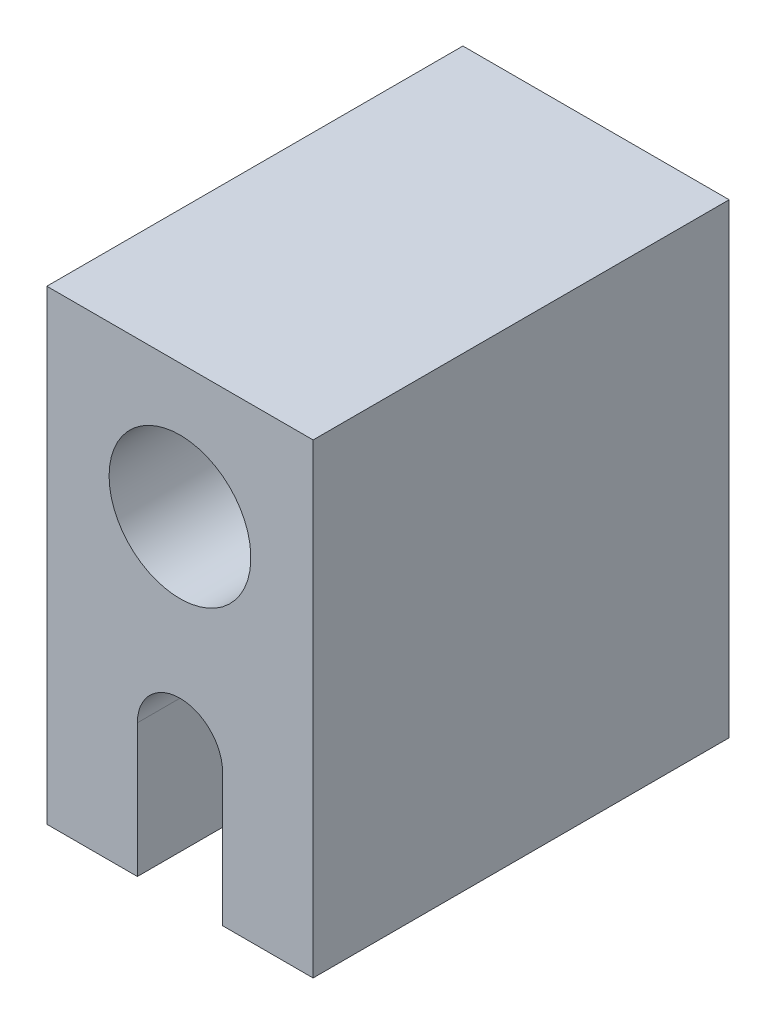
from build123d import *

# Parameters (mm, degrees)
EXTRUDE1_DEPTH        = 7.9375
F_6_32_TAPPED_HOLE1_D = 2.7051


with BuildPart() as part:
    # Sketch1 → Extrude1 (new body)
    with BuildSketch(Plane.XY):
        with BuildLine():
            Line((-0.8128, 0), (-0.8128, 2.54))
            ThreePointArc((-0.8128, 2.54), (0, 3.3528), (0.8128, 2.54))
            Line((0.8128, 2.54), (0.8128, 0))
            Line((0.8128, 0), (2.54, 0))
            Line((2.54, 0), (2.54, 8.89))
            Line((2.54, 8.89), (-2.54, 8.89))
            Line((-2.54, 8.89), (-2.54, 0))
            Line((-2.54, 0), (-0.8128, 0))
        make_face()
    extrude(amount=EXTRUDE1_DEPTH)

    # 6-32 Tapped Hole1 (through all)
    with Locations(Plane(origin=(0, 0, 0), x_dir=(-1, 0, 0), z_dir=(0, 0, -1))):
        with Locations((0, 6.35)):
            Hole(F_6_32_TAPPED_HOLE1_D / 2)


solid = part.part
